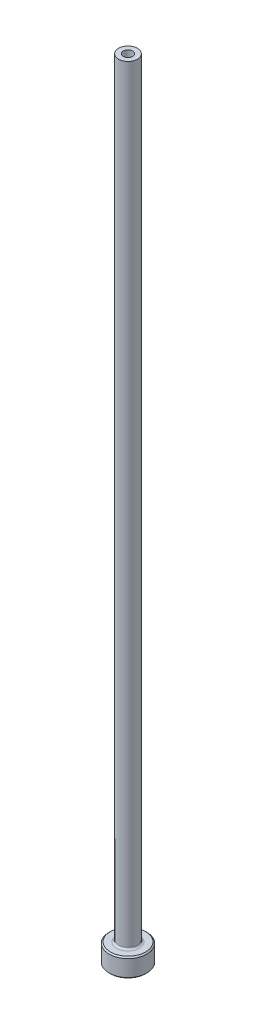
from build123d import *

# Parameters (mm, degrees)
FILLET1_R     = 0.3
CHAMFER1_SIZE = 0.2
CHAMFER3_SIZE = 0.5


with BuildPart() as part:
    # Sketch1 → Revolve1 (revolve)
    with BuildSketch(Plane.XY, mode=Mode.PRIVATE) as revolve1_sk:
        Polygon((-0.75, 125), (-1.5, 125), (-1.5, 3), (-3, 3), (-3, 0), (-1, 0), (-1, 78), (-0.75, 90), align=None)
    revolve(revolve1_sk.sketch.rotate(Axis((0, 92.187680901, 0), (0, -1, 0)), 270), axis=Axis((0, 92.187680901, 0), (0, -1, 0)))

    # Fillet1
    fillet1_edges = [part.edges().sort_by_distance(p)[0] for p in [
        (0, 3, -1.5),
    ]]
    fillet(fillet1_edges, radius=FILLET1_R)

    # Chamfer1
    chamfer1_edges = [part.edges().sort_by_distance(p)[0] for p in [
        (0, 0, -3),
        (0, 3, -3),
    ]]
    chamfer(chamfer1_edges, length=CHAMFER1_SIZE)

    # Chamfer3
    chamfer3_edges = [part.edges().sort_by_distance(p)[0] for p in [
        (0, 0, -1),
    ]]
    chamfer(chamfer3_edges, length=CHAMFER3_SIZE)


solid = part.part
